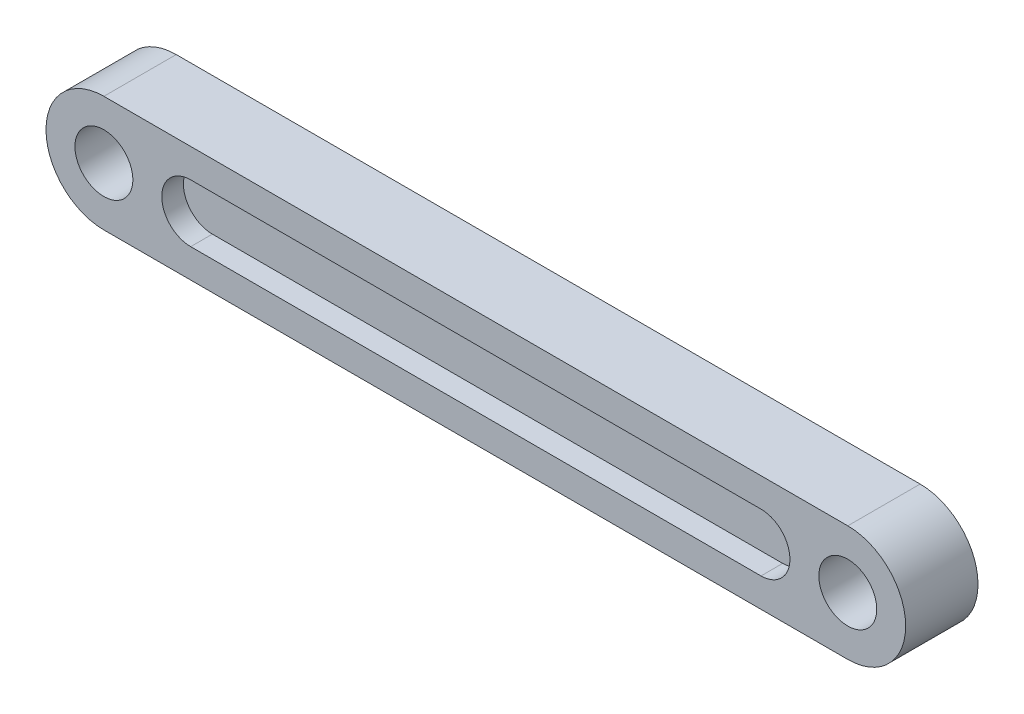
ISO-10303-21;
HEADER;
FILE_DESCRIPTION(('STEP AP214'),'2;1');
FILE_NAME('part.step','',(''),(''),'','','');
FILE_SCHEMA(('AUTOMOTIVE_DESIGN { 1 0 10303 214 1 1 1 1 }'));
ENDSEC;
DATA;
#1=APPLICATION_CONTEXT('core data for automotive mechanical design processes');
#2=APPLICATION_PROTOCOL_DEFINITION('international standard','automotive_design',2000,#1);
#3=PRODUCT_CONTEXT('',#1,'mechanical');
#4=PRODUCT('Part','Part','',(#3));
#5=PRODUCT_RELATED_PRODUCT_CATEGORY('part','',(#4));
#6=PRODUCT_DEFINITION_FORMATION('','',#4);
#7=PRODUCT_DEFINITION_CONTEXT('part definition',#1,'design');
#8=PRODUCT_DEFINITION('design','',#6,#7);
#9=PRODUCT_DEFINITION_SHAPE('','',#8);
#10=(LENGTH_UNIT() NAMED_UNIT(*) SI_UNIT(.MILLI.,.METRE.));
#11=(NAMED_UNIT(*) PLANE_ANGLE_UNIT() SI_UNIT($,.RADIAN.));
#12=(NAMED_UNIT(*) SI_UNIT($,.STERADIAN.) SOLID_ANGLE_UNIT());
#13=UNCERTAINTY_MEASURE_WITH_UNIT(LENGTH_MEASURE(1.E-05),#10,'distance_accuracy_value','');
#14=(GEOMETRIC_REPRESENTATION_CONTEXT(3) GLOBAL_UNCERTAINTY_ASSIGNED_CONTEXT((#13)) GLOBAL_UNIT_ASSIGNED_CONTEXT((#10,
#11,#12)) REPRESENTATION_CONTEXT('',''));
#15=CARTESIAN_POINT('',(0.,0.,0.));
#16=DIRECTION('',(0.,0.,1.));
#17=DIRECTION('',(1.,0.,0.));
#18=AXIS2_PLACEMENT_3D('',#15,#16,#17);
#19=CARTESIAN_POINT('',(0.,0.,5.));
#20=DIRECTION('',(0.,0.,-1.));
#21=DIRECTION('',(-1.,0.,0.));
#22=AXIS2_PLACEMENT_3D('',#19,#20,#21);
#23=CYLINDRICAL_SURFACE('',#22,4.);
#24=CARTESIAN_POINT('',(0.,0.,0.));
#25=DIRECTION('',(0.,0.,-1.));
#26=DIRECTION('',(-1.,0.,0.));
#27=AXIS2_PLACEMENT_3D('',#24,#25,#26);
#28=CIRCLE('',#27,4.);
#29=CARTESIAN_POINT('',(0.,-4.,0.));
#30=VERTEX_POINT('',#29);
#31=CARTESIAN_POINT('',(0.,4.,0.));
#32=VERTEX_POINT('',#31);
#33=EDGE_CURVE('E188',#30,#32,#28,.T.);
#34=ORIENTED_EDGE('',*,*,#33,.F.);
#35=DIRECTION('',(0.,0.,-1.));
#36=VECTOR('',#35,1.);
#37=CARTESIAN_POINT('',(0.,-4.,5.));
#38=LINE('',#37,#36);
#39=CARTESIAN_POINT('',(0.,-4.,5.));
#40=VERTEX_POINT('',#39);
#41=EDGE_CURVE('E11',#40,#30,#38,.T.);
#42=ORIENTED_EDGE('',*,*,#41,.F.);
#43=CARTESIAN_POINT('',(0.,0.,5.));
#44=DIRECTION('',(0.,0.,-1.));
#45=DIRECTION('',(-1.,0.,0.));
#46=AXIS2_PLACEMENT_3D('',#43,#44,#45);
#47=CIRCLE('',#46,4.);
#48=CARTESIAN_POINT('',(0.,4.,5.));
#49=VERTEX_POINT('',#48);
#50=EDGE_CURVE('E194',#40,#49,#47,.T.);
#51=ORIENTED_EDGE('',*,*,#50,.T.);
#52=DIRECTION('',(0.,0.,-1.));
#53=VECTOR('',#52,1.);
#54=CARTESIAN_POINT('',(0.,4.,5.));
#55=LINE('',#54,#53);
#56=EDGE_CURVE('E36',#49,#32,#55,.T.);
#57=ORIENTED_EDGE('',*,*,#56,.T.);
#58=EDGE_LOOP('',(#34,#42,#51,#57));
#59=FACE_BOUND('',#58,.T.);
#60=ADVANCED_FACE('F33',(#59),#23,.T.);
#61=CARTESIAN_POINT('',(51.4197,-4.,5.));
#62=DIRECTION('',(0.,-1.,0.));
#63=DIRECTION('',(1.,0.,0.));
#64=AXIS2_PLACEMENT_3D('',#61,#62,#63);
#65=PLANE('',#64);
#66=DIRECTION('',(-1.,0.,0.));
#67=VECTOR('',#66,1.);
#68=CARTESIAN_POINT('',(51.4197,-4.,0.));
#69=LINE('',#68,#67);
#70=CARTESIAN_POINT('',(51.4197,-4.,0.));
#71=VERTEX_POINT('',#70);
#72=EDGE_CURVE('E198',#71,#30,#69,.T.);
#73=ORIENTED_EDGE('',*,*,#72,.F.);
#74=DIRECTION('',(0.,0.,-1.));
#75=VECTOR('',#74,1.);
#76=CARTESIAN_POINT('',(51.4197,-4.,5.));
#77=LINE('',#76,#75);
#78=CARTESIAN_POINT('',(51.4197,-4.,5.));
#79=VERTEX_POINT('',#78);
#80=EDGE_CURVE('E41',#79,#71,#77,.T.);
#81=ORIENTED_EDGE('',*,*,#80,.F.);
#82=DIRECTION('',(-1.,0.,0.));
#83=VECTOR('',#82,1.);
#84=CARTESIAN_POINT('',(51.4197,-4.,5.));
#85=LINE('',#84,#83);
#86=EDGE_CURVE('E204',#79,#40,#85,.T.);
#87=ORIENTED_EDGE('',*,*,#86,.T.);
#88=ORIENTED_EDGE('',*,*,#41,.T.);
#89=EDGE_LOOP('',(#73,#81,#87,#88));
#90=FACE_BOUND('',#89,.T.);
#91=ADVANCED_FACE('F230',(#90),#65,.T.);
#92=CARTESIAN_POINT('',(51.4197,0.,5.));
#93=DIRECTION('',(0.,0.,-1.));
#94=DIRECTION('',(-1.,0.,0.));
#95=AXIS2_PLACEMENT_3D('',#92,#93,#94);
#96=CYLINDRICAL_SURFACE('',#95,4.);
#97=CARTESIAN_POINT('',(51.4197,0.,0.));
#98=DIRECTION('',(0.,0.,-1.));
#99=DIRECTION('',(-1.,0.,0.));
#100=AXIS2_PLACEMENT_3D('',#97,#98,#99);
#101=CIRCLE('',#100,4.);
#102=CARTESIAN_POINT('',(51.4197,4.,0.));
#103=VERTEX_POINT('',#102);
#104=EDGE_CURVE('E212',#103,#71,#101,.T.);
#105=ORIENTED_EDGE('',*,*,#104,.F.);
#106=DIRECTION('',(0.,0.,-1.));
#107=VECTOR('',#106,1.);
#108=CARTESIAN_POINT('',(51.4197,4.,5.));
#109=LINE('',#108,#107);
#110=CARTESIAN_POINT('',(51.4197,4.,5.));
#111=VERTEX_POINT('',#110);
#112=EDGE_CURVE('E217',#111,#103,#109,.T.);
#113=ORIENTED_EDGE('',*,*,#112,.F.);
#114=CARTESIAN_POINT('',(51.4197,0.,5.));
#115=DIRECTION('',(0.,0.,-1.));
#116=DIRECTION('',(-1.,0.,0.));
#117=AXIS2_PLACEMENT_3D('',#114,#115,#116);
#118=CIRCLE('',#117,4.);
#119=EDGE_CURVE('E201',#111,#79,#118,.T.);
#120=ORIENTED_EDGE('',*,*,#119,.T.);
#121=ORIENTED_EDGE('',*,*,#80,.T.);
#122=EDGE_LOOP('',(#105,#113,#120,#121));
#123=FACE_BOUND('',#122,.T.);
#124=ADVANCED_FACE('F236',(#123),#96,.T.);
#125=CARTESIAN_POINT('',(0.,4.,5.));
#126=DIRECTION('',(0.,1.,0.));
#127=DIRECTION('',(-1.,0.,0.));
#128=AXIS2_PLACEMENT_3D('',#125,#126,#127);
#129=PLANE('',#128);
#130=DIRECTION('',(1.,0.,0.));
#131=VECTOR('',#130,1.);
#132=CARTESIAN_POINT('',(0.,4.,0.));
#133=LINE('',#132,#131);
#134=EDGE_CURVE('E209',#32,#103,#133,.T.);
#135=ORIENTED_EDGE('',*,*,#134,.F.);
#136=ORIENTED_EDGE('',*,*,#56,.F.);
#137=DIRECTION('',(1.,0.,0.));
#138=VECTOR('',#137,1.);
#139=CARTESIAN_POINT('',(0.,4.,5.));
#140=LINE('',#139,#138);
#141=EDGE_CURVE('E197',#49,#111,#140,.T.);
#142=ORIENTED_EDGE('',*,*,#141,.T.);
#143=ORIENTED_EDGE('',*,*,#112,.T.);
#144=EDGE_LOOP('',(#135,#136,#142,#143));
#145=FACE_BOUND('',#144,.T.);
#146=ADVANCED_FACE('F225',(#145),#129,.T.);
#147=CARTESIAN_POINT('',(0.,0.,5.));
#148=DIRECTION('',(0.,0.,-1.));
#149=DIRECTION('',(-1.,0.,0.));
#150=AXIS2_PLACEMENT_3D('',#147,#148,#149);
#151=PLANE('',#150);
#152=CARTESIAN_POINT('',(51.4197,0.,5.));
#153=DIRECTION('',(0.,0.,-1.));
#154=DIRECTION('',(-1.,0.,0.));
#155=AXIS2_PLACEMENT_3D('',#152,#153,#154);
#156=CIRCLE('',#155,1.99999999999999);
#157=CARTESIAN_POINT('',(49.4197,0.,5.));
#158=VERTEX_POINT('',#157);
#159=EDGE_CURVE('E399',#158,#158,#156,.T.);
#160=ORIENTED_EDGE('',*,*,#159,.T.);
#161=EDGE_LOOP('',(#160));
#162=FACE_BOUND('',#161,.T.);
#163=CARTESIAN_POINT('',(0.,0.,5.));
#164=DIRECTION('',(0.,0.,-1.));
#165=DIRECTION('',(-1.,0.,0.));
#166=AXIS2_PLACEMENT_3D('',#163,#164,#165);
#167=CIRCLE('',#166,1.99999999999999);
#168=CARTESIAN_POINT('',(-1.99999999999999,0.,5.));
#169=VERTEX_POINT('',#168);
#170=EDGE_CURVE('E148',#169,#169,#167,.T.);
#171=ORIENTED_EDGE('',*,*,#170,.T.);
#172=EDGE_LOOP('',(#171));
#173=FACE_BOUND('',#172,.T.);
#174=DIRECTION('',(1.,0.,0.));
#175=VECTOR('',#174,1.);
#176=CARTESIAN_POINT('',(6.,-2.,5.));
#177=LINE('',#176,#175);
#178=CARTESIAN_POINT('',(6.,-2.,5.));
#179=VERTEX_POINT('',#178);
#180=CARTESIAN_POINT('',(45.4197,-2.,5.));
#181=VERTEX_POINT('',#180);
#182=EDGE_CURVE('E154',#179,#181,#177,.T.);
#183=ORIENTED_EDGE('',*,*,#182,.F.);
#184=CARTESIAN_POINT('',(6.,0.,5.));
#185=DIRECTION('',(0.,0.,1.));
#186=DIRECTION('',(1.,0.,0.));
#187=AXIS2_PLACEMENT_3D('',#184,#185,#186);
#188=CIRCLE('',#187,2.);
#189=CARTESIAN_POINT('',(6.,2.,5.));
#190=VERTEX_POINT('',#189);
#191=EDGE_CURVE('E49',#190,#179,#188,.T.);
#192=ORIENTED_EDGE('',*,*,#191,.F.);
#193=DIRECTION('',(-1.,0.,0.));
#194=VECTOR('',#193,1.);
#195=CARTESIAN_POINT('',(45.4197,2.,5.));
#196=LINE('',#195,#194);
#197=CARTESIAN_POINT('',(45.4197,2.,5.));
#198=VERTEX_POINT('',#197);
#199=EDGE_CURVE('E142',#198,#190,#196,.T.);
#200=ORIENTED_EDGE('',*,*,#199,.F.);
#201=CARTESIAN_POINT('',(45.4197,0.,5.));
#202=DIRECTION('',(0.,0.,1.));
#203=DIRECTION('',(1.,0.,0.));
#204=AXIS2_PLACEMENT_3D('',#201,#202,#203);
#205=CIRCLE('',#204,2.);
#206=EDGE_CURVE('E145',#181,#198,#205,.T.);
#207=ORIENTED_EDGE('',*,*,#206,.F.);
#208=EDGE_LOOP('',(#183,#192,#200,#207));
#209=FACE_BOUND('',#208,.T.);
#210=ORIENTED_EDGE('',*,*,#50,.F.);
#211=ORIENTED_EDGE('',*,*,#86,.F.);
#212=ORIENTED_EDGE('',*,*,#119,.F.);
#213=ORIENTED_EDGE('',*,*,#141,.F.);
#214=EDGE_LOOP('',(#210,#211,#212,#213));
#215=FACE_BOUND('',#214,.T.);
#216=ADVANCED_FACE('F233',(#162,#173,#209,#215),#151,.F.);
#217=CARTESIAN_POINT('',(0.,0.,0.));
#218=DIRECTION('',(0.,0.,-1.));
#219=DIRECTION('',(-1.,0.,0.));
#220=AXIS2_PLACEMENT_3D('',#217,#218,#219);
#221=PLANE('',#220);
#222=CARTESIAN_POINT('',(51.4197,0.,0.));
#223=DIRECTION('',(0.,0.,-1.));
#224=DIRECTION('',(-1.,0.,0.));
#225=AXIS2_PLACEMENT_3D('',#222,#223,#224);
#226=CIRCLE('',#225,1.99999999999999);
#227=CARTESIAN_POINT('',(49.4197,0.,0.));
#228=VERTEX_POINT('',#227);
#229=EDGE_CURVE('E402',#228,#228,#226,.T.);
#230=ORIENTED_EDGE('',*,*,#229,.F.);
#231=EDGE_LOOP('',(#230));
#232=FACE_BOUND('',#231,.T.);
#233=CARTESIAN_POINT('',(0.,0.,0.));
#234=DIRECTION('',(0.,0.,-1.));
#235=DIRECTION('',(-1.,0.,0.));
#236=AXIS2_PLACEMENT_3D('',#233,#234,#235);
#237=CIRCLE('',#236,1.99999999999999);
#238=CARTESIAN_POINT('',(-1.99999999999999,0.,0.));
#239=VERTEX_POINT('',#238);
#240=EDGE_CURVE('E404',#239,#239,#237,.T.);
#241=ORIENTED_EDGE('',*,*,#240,.F.);
#242=EDGE_LOOP('',(#241));
#243=FACE_BOUND('',#242,.T.);
#244=CARTESIAN_POINT('',(6.,0.,0.));
#245=DIRECTION('',(0.,0.,-1.));
#246=DIRECTION('',(-1.,0.,0.));
#247=AXIS2_PLACEMENT_3D('',#244,#245,#246);
#248=CIRCLE('',#247,2.5);
#249=CARTESIAN_POINT('',(6.,-2.5,0.));
#250=VERTEX_POINT('',#249);
#251=CARTESIAN_POINT('',(6.,2.5,0.));
#252=VERTEX_POINT('',#251);
#253=EDGE_CURVE('E57',#250,#252,#248,.T.);
#254=ORIENTED_EDGE('',*,*,#253,.F.);
#255=DIRECTION('',(-1.,0.,0.));
#256=VECTOR('',#255,1.);
#257=CARTESIAN_POINT('',(45.4197,-2.5,0.));
#258=LINE('',#257,#256);
#259=CARTESIAN_POINT('',(45.4197,-2.5,0.));
#260=VERTEX_POINT('',#259);
#261=EDGE_CURVE('E167',#260,#250,#258,.T.);
#262=ORIENTED_EDGE('',*,*,#261,.F.);
#263=CARTESIAN_POINT('',(45.4197,0.,0.));
#264=DIRECTION('',(0.,0.,-1.));
#265=DIRECTION('',(-1.,0.,0.));
#266=AXIS2_PLACEMENT_3D('',#263,#264,#265);
#267=CIRCLE('',#266,2.5);
#268=CARTESIAN_POINT('',(45.4197,2.5,0.));
#269=VERTEX_POINT('',#268);
#270=EDGE_CURVE('E181',#269,#260,#267,.T.);
#271=ORIENTED_EDGE('',*,*,#270,.F.);
#272=DIRECTION('',(1.,0.,0.));
#273=VECTOR('',#272,1.);
#274=CARTESIAN_POINT('',(6.,2.5,0.));
#275=LINE('',#274,#273);
#276=EDGE_CURVE('E178',#252,#269,#275,.T.);
#277=ORIENTED_EDGE('',*,*,#276,.F.);
#278=EDGE_LOOP('',(#254,#262,#271,#277));
#279=FACE_BOUND('',#278,.T.);
#280=ORIENTED_EDGE('',*,*,#33,.T.);
#281=ORIENTED_EDGE('',*,*,#134,.T.);
#282=ORIENTED_EDGE('',*,*,#104,.T.);
#283=ORIENTED_EDGE('',*,*,#72,.T.);
#284=EDGE_LOOP('',(#280,#281,#282,#283));
#285=FACE_BOUND('',#284,.T.);
#286=ADVANCED_FACE('F227',(#232,#243,#279,#285),#221,.T.);
#287=CARTESIAN_POINT('',(6.,0.,1.5));
#288=DIRECTION('',(0.,0.,-1.));
#289=DIRECTION('',(-1.,0.,0.));
#290=AXIS2_PLACEMENT_3D('',#287,#288,#289);
#291=CYLINDRICAL_SURFACE('',#290,2.5);
#292=ORIENTED_EDGE('',*,*,#253,.T.);
#293=DIRECTION('',(0.,0.,-1.));
#294=VECTOR('',#293,1.);
#295=CARTESIAN_POINT('',(6.,2.5,1.5));
#296=LINE('',#295,#294);
#297=CARTESIAN_POINT('',(6.,2.5,1.5));
#298=VERTEX_POINT('',#297);
#299=EDGE_CURVE('E176',#298,#252,#296,.T.);
#300=ORIENTED_EDGE('',*,*,#299,.F.);
#301=CARTESIAN_POINT('',(6.,0.,1.5));
#302=DIRECTION('',(0.,0.,-1.));
#303=DIRECTION('',(-1.,0.,0.));
#304=AXIS2_PLACEMENT_3D('',#301,#302,#303);
#305=CIRCLE('',#304,2.5);
#306=CARTESIAN_POINT('',(6.,-2.5,1.5));
#307=VERTEX_POINT('',#306);
#308=EDGE_CURVE('E163',#307,#298,#305,.T.);
#309=ORIENTED_EDGE('',*,*,#308,.F.);
#310=DIRECTION('',(0.,0.,-1.));
#311=VECTOR('',#310,1.);
#312=CARTESIAN_POINT('',(6.,-2.5,1.5));
#313=LINE('',#312,#311);
#314=EDGE_CURVE('E186',#307,#250,#313,.T.);
#315=ORIENTED_EDGE('',*,*,#314,.T.);
#316=EDGE_LOOP('',(#292,#300,#309,#315));
#317=FACE_BOUND('',#316,.T.);
#318=ADVANCED_FACE('F268',(#317),#291,.F.);
#319=CARTESIAN_POINT('',(45.4197,-2.5,1.5));
#320=DIRECTION('',(0.,-1.,0.));
#321=DIRECTION('',(1.,0.,0.));
#322=AXIS2_PLACEMENT_3D('',#319,#320,#321);
#323=PLANE('',#322);
#324=ORIENTED_EDGE('',*,*,#261,.T.);
#325=ORIENTED_EDGE('',*,*,#314,.F.);
#326=DIRECTION('',(-1.,0.,0.));
#327=VECTOR('',#326,1.);
#328=CARTESIAN_POINT('',(45.4197,-2.5,1.5));
#329=LINE('',#328,#327);
#330=CARTESIAN_POINT('',(45.4197,-2.5,1.5));
#331=VERTEX_POINT('',#330);
#332=EDGE_CURVE('E173',#331,#307,#329,.T.);
#333=ORIENTED_EDGE('',*,*,#332,.F.);
#334=DIRECTION('',(0.,0.,-1.));
#335=VECTOR('',#334,1.);
#336=CARTESIAN_POINT('',(45.4197,-2.5,1.5));
#337=LINE('',#336,#335);
#338=EDGE_CURVE('E189',#331,#260,#337,.T.);
#339=ORIENTED_EDGE('',*,*,#338,.T.);
#340=EDGE_LOOP('',(#324,#325,#333,#339));
#341=FACE_BOUND('',#340,.T.);
#342=ADVANCED_FACE('F273',(#341),#323,.F.);
#343=CARTESIAN_POINT('',(45.4197,0.,1.5));
#344=DIRECTION('',(0.,0.,-1.));
#345=DIRECTION('',(-1.,0.,0.));
#346=AXIS2_PLACEMENT_3D('',#343,#344,#345);
#347=CYLINDRICAL_SURFACE('',#346,2.5);
#348=ORIENTED_EDGE('',*,*,#270,.T.);
#349=ORIENTED_EDGE('',*,*,#338,.F.);
#350=CARTESIAN_POINT('',(45.4197,0.,1.5));
#351=DIRECTION('',(0.,0.,-1.));
#352=DIRECTION('',(-1.,0.,0.));
#353=AXIS2_PLACEMENT_3D('',#350,#351,#352);
#354=CIRCLE('',#353,2.5);
#355=CARTESIAN_POINT('',(45.4197,2.5,1.5));
#356=VERTEX_POINT('',#355);
#357=EDGE_CURVE('E170',#356,#331,#354,.T.);
#358=ORIENTED_EDGE('',*,*,#357,.F.);
#359=DIRECTION('',(0.,0.,-1.));
#360=VECTOR('',#359,1.);
#361=CARTESIAN_POINT('',(45.4197,2.5,1.5));
#362=LINE('',#361,#360);
#363=EDGE_CURVE('E191',#356,#269,#362,.T.);
#364=ORIENTED_EDGE('',*,*,#363,.T.);
#365=EDGE_LOOP('',(#348,#349,#358,#364));
#366=FACE_BOUND('',#365,.T.);
#367=ADVANCED_FACE('F284',(#366),#347,.F.);
#368=CARTESIAN_POINT('',(6.,2.5,1.5));
#369=DIRECTION('',(0.,1.,0.));
#370=DIRECTION('',(-1.,0.,0.));
#371=AXIS2_PLACEMENT_3D('',#368,#369,#370);
#372=PLANE('',#371);
#373=ORIENTED_EDGE('',*,*,#276,.T.);
#374=ORIENTED_EDGE('',*,*,#363,.F.);
#375=DIRECTION('',(1.,0.,0.));
#376=VECTOR('',#375,1.);
#377=CARTESIAN_POINT('',(6.,2.5,1.5));
#378=LINE('',#377,#376);
#379=EDGE_CURVE('E166',#298,#356,#378,.T.);
#380=ORIENTED_EDGE('',*,*,#379,.F.);
#381=ORIENTED_EDGE('',*,*,#299,.T.);
#382=EDGE_LOOP('',(#373,#374,#380,#381));
#383=FACE_BOUND('',#382,.T.);
#384=ADVANCED_FACE('F294',(#383),#372,.F.);
#385=CARTESIAN_POINT('',(6.,0.,1.5));
#386=DIRECTION('',(0.,0.,-1.));
#387=DIRECTION('',(-1.,0.,0.));
#388=AXIS2_PLACEMENT_3D('',#385,#386,#387);
#389=PLANE('',#388);
#390=ORIENTED_EDGE('',*,*,#308,.T.);
#391=ORIENTED_EDGE('',*,*,#379,.T.);
#392=ORIENTED_EDGE('',*,*,#357,.T.);
#393=ORIENTED_EDGE('',*,*,#332,.T.);
#394=EDGE_LOOP('',(#390,#391,#392,#393));
#395=FACE_BOUND('',#394,.T.);
#396=ADVANCED_FACE('F304',(#395),#389,.T.);
#397=CARTESIAN_POINT('',(6.,0.,3.5));
#398=DIRECTION('',(0.,0.,1.));
#399=DIRECTION('',(1.,0.,0.));
#400=AXIS2_PLACEMENT_3D('',#397,#398,#399);
#401=CYLINDRICAL_SURFACE('',#400,2.);
#402=ORIENTED_EDGE('',*,*,#191,.T.);
#403=DIRECTION('',(0.,0.,1.));
#404=VECTOR('',#403,1.);
#405=CARTESIAN_POINT('',(6.,-2.,3.5));
#406=LINE('',#405,#404);
#407=CARTESIAN_POINT('',(6.,-2.,3.5));
#408=VERTEX_POINT('',#407);
#409=EDGE_CURVE('E120',#408,#179,#406,.T.);
#410=ORIENTED_EDGE('',*,*,#409,.F.);
#411=CARTESIAN_POINT('',(6.,0.,3.5));
#412=DIRECTION('',(0.,0.,1.));
#413=DIRECTION('',(1.,0.,0.));
#414=AXIS2_PLACEMENT_3D('',#411,#412,#413);
#415=CIRCLE('',#414,2.);
#416=CARTESIAN_POINT('',(6.,2.,3.5));
#417=VERTEX_POINT('',#416);
#418=EDGE_CURVE('E124',#417,#408,#415,.T.);
#419=ORIENTED_EDGE('',*,*,#418,.F.);
#420=DIRECTION('',(0.,0.,1.));
#421=VECTOR('',#420,1.);
#422=CARTESIAN_POINT('',(6.,2.,3.5));
#423=LINE('',#422,#421);
#424=EDGE_CURVE('E158',#417,#190,#423,.T.);
#425=ORIENTED_EDGE('',*,*,#424,.T.);
#426=EDGE_LOOP('',(#402,#410,#419,#425));
#427=FACE_BOUND('',#426,.T.);
#428=ADVANCED_FACE('F122',(#427),#401,.F.);
#429=CARTESIAN_POINT('',(45.4197,2.,3.5));
#430=DIRECTION('',(0.,1.,0.));
#431=DIRECTION('',(-1.,0.,0.));
#432=AXIS2_PLACEMENT_3D('',#429,#430,#431);
#433=PLANE('',#432);
#434=ORIENTED_EDGE('',*,*,#199,.T.);
#435=ORIENTED_EDGE('',*,*,#424,.F.);
#436=DIRECTION('',(-1.,0.,0.));
#437=VECTOR('',#436,1.);
#438=CARTESIAN_POINT('',(45.4197,2.,3.5));
#439=LINE('',#438,#437);
#440=CARTESIAN_POINT('',(45.4197,2.,3.5));
#441=VERTEX_POINT('',#440);
#442=EDGE_CURVE('E130',#441,#417,#439,.T.);
#443=ORIENTED_EDGE('',*,*,#442,.F.);
#444=DIRECTION('',(0.,0.,1.));
#445=VECTOR('',#444,1.);
#446=CARTESIAN_POINT('',(45.4197,2.,3.5));
#447=LINE('',#446,#445);
#448=EDGE_CURVE('E160',#441,#198,#447,.T.);
#449=ORIENTED_EDGE('',*,*,#448,.T.);
#450=EDGE_LOOP('',(#434,#435,#443,#449));
#451=FACE_BOUND('',#450,.T.);
#452=ADVANCED_FACE('F323',(#451),#433,.F.);
#453=CARTESIAN_POINT('',(45.4197,0.,3.5));
#454=DIRECTION('',(0.,0.,1.));
#455=DIRECTION('',(1.,0.,0.));
#456=AXIS2_PLACEMENT_3D('',#453,#454,#455);
#457=CYLINDRICAL_SURFACE('',#456,2.);
#458=ORIENTED_EDGE('',*,*,#206,.T.);
#459=ORIENTED_EDGE('',*,*,#448,.F.);
#460=CARTESIAN_POINT('',(45.4197,0.,3.5));
#461=DIRECTION('',(0.,0.,1.));
#462=DIRECTION('',(1.,0.,0.));
#463=AXIS2_PLACEMENT_3D('',#460,#461,#462);
#464=CIRCLE('',#463,2.);
#465=CARTESIAN_POINT('',(45.4197,-2.,3.5));
#466=VERTEX_POINT('',#465);
#467=EDGE_CURVE('E138',#466,#441,#464,.T.);
#468=ORIENTED_EDGE('',*,*,#467,.F.);
#469=DIRECTION('',(0.,0.,1.));
#470=VECTOR('',#469,1.);
#471=CARTESIAN_POINT('',(45.4197,-2.,3.5));
#472=LINE('',#471,#470);
#473=EDGE_CURVE('E129',#466,#181,#472,.T.);
#474=ORIENTED_EDGE('',*,*,#473,.T.);
#475=EDGE_LOOP('',(#458,#459,#468,#474));
#476=FACE_BOUND('',#475,.T.);
#477=ADVANCED_FACE('F332',(#476),#457,.F.);
#478=CARTESIAN_POINT('',(6.,-2.,3.5));
#479=DIRECTION('',(0.,-1.,0.));
#480=DIRECTION('',(0.,0.,-1.));
#481=AXIS2_PLACEMENT_3D('',#478,#479,#480);
#482=PLANE('',#481);
#483=ORIENTED_EDGE('',*,*,#182,.T.);
#484=ORIENTED_EDGE('',*,*,#473,.F.);
#485=DIRECTION('',(1.,0.,0.));
#486=VECTOR('',#485,1.);
#487=CARTESIAN_POINT('',(6.,-2.,3.5));
#488=LINE('',#487,#486);
#489=EDGE_CURVE('E133',#408,#466,#488,.T.);
#490=ORIENTED_EDGE('',*,*,#489,.F.);
#491=ORIENTED_EDGE('',*,*,#409,.T.);
#492=EDGE_LOOP('',(#483,#484,#490,#491));
#493=FACE_BOUND('',#492,.T.);
#494=ADVANCED_FACE('F134',(#493),#482,.F.);
#495=CARTESIAN_POINT('',(6.,0.,3.5));
#496=DIRECTION('',(0.,0.,1.));
#497=DIRECTION('',(1.,0.,0.));
#498=AXIS2_PLACEMENT_3D('',#495,#496,#497);
#499=PLANE('',#498);
#500=ORIENTED_EDGE('',*,*,#418,.T.);
#501=ORIENTED_EDGE('',*,*,#489,.T.);
#502=ORIENTED_EDGE('',*,*,#467,.T.);
#503=ORIENTED_EDGE('',*,*,#442,.T.);
#504=EDGE_LOOP('',(#500,#501,#502,#503));
#505=FACE_BOUND('',#504,.T.);
#506=ADVANCED_FACE('F140',(#505),#499,.T.);
#507=CARTESIAN_POINT('',(0.,0.,0.));
#508=DIRECTION('',(0.,0.,-1.));
#509=DIRECTION('',(-1.,0.,0.));
#510=AXIS2_PLACEMENT_3D('',#507,#508,#509);
#511=CYLINDRICAL_SURFACE('',#510,1.99999999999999);
#512=ORIENTED_EDGE('',*,*,#170,.F.);
#513=EDGE_LOOP('',(#512));
#514=FACE_BOUND('',#513,.T.);
#515=ORIENTED_EDGE('',*,*,#240,.T.);
#516=EDGE_LOOP('',(#515));
#517=FACE_BOUND('',#516,.T.);
#518=ADVANCED_FACE('F359',(#514,#517),#511,.F.);
#519=CARTESIAN_POINT('',(51.4197,0.,0.));
#520=DIRECTION('',(0.,0.,-1.));
#521=DIRECTION('',(-1.,0.,0.));
#522=AXIS2_PLACEMENT_3D('',#519,#520,#521);
#523=CYLINDRICAL_SURFACE('',#522,1.99999999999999);
#524=ORIENTED_EDGE('',*,*,#159,.F.);
#525=EDGE_LOOP('',(#524));
#526=FACE_BOUND('',#525,.T.);
#527=ORIENTED_EDGE('',*,*,#229,.T.);
#528=EDGE_LOOP('',(#527));
#529=FACE_BOUND('',#528,.T.);
#530=ADVANCED_FACE('F382',(#526,#529),#523,.F.);
#531=CLOSED_SHELL('',(#60,#91,#124,#146,#216,#286,#318,#342,#367,#384,#396,#428,#452,#477,#494,
#506,#518,#530));
#532=MANIFOLD_SOLID_BREP('B2',#531);
#533=ADVANCED_BREP_SHAPE_REPRESENTATION('',(#18,#532),#14);
#534=SHAPE_DEFINITION_REPRESENTATION(#9,#533);
ENDSEC;
END-ISO-10303-21;
